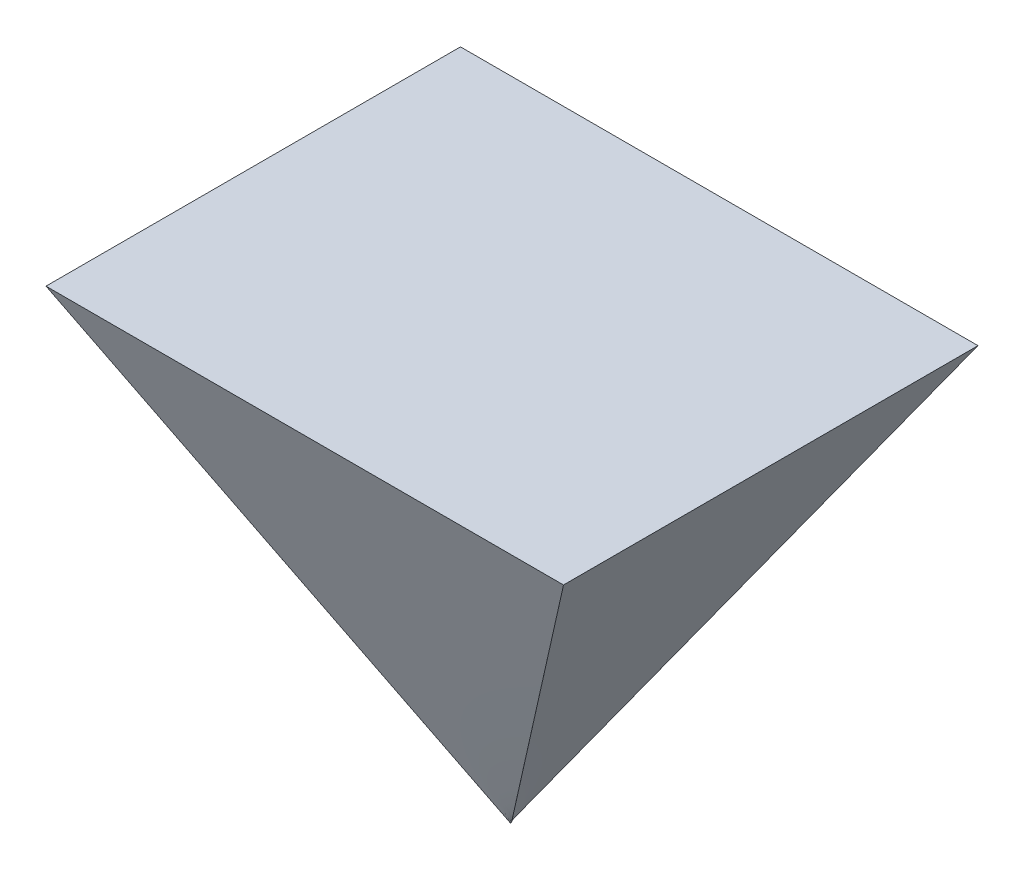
ISO-10303-21;
HEADER;
FILE_DESCRIPTION(('STEP AP214'),'2;1');
FILE_NAME('part.step','',(''),(''),'','','');
FILE_SCHEMA(('AUTOMOTIVE_DESIGN { 1 0 10303 214 1 1 1 1 }'));
ENDSEC;
DATA;
#1=APPLICATION_CONTEXT('core data for automotive mechanical design processes');
#2=APPLICATION_PROTOCOL_DEFINITION('international standard','automotive_design',2000,#1);
#3=PRODUCT_CONTEXT('',#1,'mechanical');
#4=PRODUCT('Part','Part','',(#3));
#5=PRODUCT_RELATED_PRODUCT_CATEGORY('part','',(#4));
#6=PRODUCT_DEFINITION_FORMATION('','',#4);
#7=PRODUCT_DEFINITION_CONTEXT('part definition',#1,'design');
#8=PRODUCT_DEFINITION('design','',#6,#7);
#9=PRODUCT_DEFINITION_SHAPE('','',#8);
#10=(LENGTH_UNIT() NAMED_UNIT(*) SI_UNIT(.MILLI.,.METRE.));
#11=(NAMED_UNIT(*) PLANE_ANGLE_UNIT() SI_UNIT($,.RADIAN.));
#12=(NAMED_UNIT(*) SI_UNIT($,.STERADIAN.) SOLID_ANGLE_UNIT());
#13=UNCERTAINTY_MEASURE_WITH_UNIT(LENGTH_MEASURE(1.E-05),#10,'distance_accuracy_value','');
#14=(GEOMETRIC_REPRESENTATION_CONTEXT(3) GLOBAL_UNCERTAINTY_ASSIGNED_CONTEXT((#13)) GLOBAL_UNIT_ASSIGNED_CONTEXT((#10,
#11,#12)) REPRESENTATION_CONTEXT('',''));
#15=CARTESIAN_POINT('',(0.,0.,0.));
#16=DIRECTION('',(0.,0.,1.));
#17=DIRECTION('',(1.,0.,0.));
#18=AXIS2_PLACEMENT_3D('',#15,#16,#17);
#19=CARTESIAN_POINT('',(2946.4,4978.4,-2354.58));
#20=DIRECTION('',(0.,1.,0.));
#21=DIRECTION('',(0.,0.,1.));
#22=AXIS2_PLACEMENT_3D('',#19,#20,#21);
#23=PLANE('',#22);
#24=DIRECTION('',(0.,0.,-1.));
#25=VECTOR('',#24,1.);
#26=CARTESIAN_POINT('',(2946.4,4978.4,2344.42));
#27=LINE('',#26,#25);
#28=CARTESIAN_POINT('',(2946.4,4978.4,2344.42));
#29=VERTEX_POINT('',#28);
#30=CARTESIAN_POINT('',(2946.4,4978.4,-2354.58));
#31=VERTEX_POINT('',#30);
#32=EDGE_CURVE('E134',#29,#31,#27,.T.);
#33=ORIENTED_EDGE('',*,*,#32,.T.);
#34=DIRECTION('',(-1.,0.,0.));
#35=VECTOR('',#34,1.);
#36=CARTESIAN_POINT('',(2946.4,4978.4,-2354.58));
#37=LINE('',#36,#35);
#38=CARTESIAN_POINT('',(-2921.,4978.4,-2354.58));
#39=VERTEX_POINT('',#38);
#40=EDGE_CURVE('E107',#31,#39,#37,.T.);
#41=ORIENTED_EDGE('',*,*,#40,.T.);
#42=DIRECTION('',(0.,0.,1.));
#43=VECTOR('',#42,1.);
#44=CARTESIAN_POINT('',(-2921.,4978.4,2344.42));
#45=LINE('',#44,#43);
#46=CARTESIAN_POINT('',(-2921.,4978.4,2344.42));
#47=VERTEX_POINT('',#46);
#48=EDGE_CURVE('E88',#39,#47,#45,.T.);
#49=ORIENTED_EDGE('',*,*,#48,.T.);
#50=DIRECTION('',(1.,0.,0.));
#51=VECTOR('',#50,1.);
#52=CARTESIAN_POINT('',(2946.4,4978.4,2344.42));
#53=LINE('',#52,#51);
#54=EDGE_CURVE('E79',#47,#29,#53,.T.);
#55=ORIENTED_EDGE('',*,*,#54,.T.);
#56=EDGE_LOOP('',(#33,#41,#49,#55));
#57=FACE_BOUND('',#56,.T.);
#58=ADVANCED_FACE('F40',(#57),#23,.T.);
#59=CARTESIAN_POINT('',(-6.477,0.,5.334));
#60=DIRECTION('',(0.,1.,0.));
#61=DIRECTION('',(0.,0.,1.));
#62=AXIS2_PLACEMENT_3D('',#59,#60,#61);
#63=PLANE('',#62);
#64=DIRECTION('',(0.,0.,1.));
#65=VECTOR('',#64,1.);
#66=CARTESIAN_POINT('',(-6.477,0.,-5.3086));
#67=LINE('',#66,#65);
#68=CARTESIAN_POINT('',(-6.477,0.,-5.3086));
#69=VERTEX_POINT('',#68);
#70=CARTESIAN_POINT('',(-6.477,0.,5.334));
#71=VERTEX_POINT('',#70);
#72=EDGE_CURVE('E197',#69,#71,#67,.T.);
#73=ORIENTED_EDGE('',*,*,#72,.F.);
#74=DIRECTION('',(-1.,0.,0.));
#75=VECTOR('',#74,1.);
#76=CARTESIAN_POINT('',(-6.477,0.,-5.3086));
#77=LINE('',#76,#75);
#78=CARTESIAN_POINT('',(6.477,0.,-5.3086));
#79=VERTEX_POINT('',#78);
#80=EDGE_CURVE('E12',#79,#69,#77,.T.);
#81=ORIENTED_EDGE('',*,*,#80,.F.);
#82=DIRECTION('',(0.,0.,-1.));
#83=VECTOR('',#82,1.);
#84=CARTESIAN_POINT('',(6.477,0.,-5.3086));
#85=LINE('',#84,#83);
#86=CARTESIAN_POINT('',(6.477,0.,5.334));
#87=VERTEX_POINT('',#86);
#88=EDGE_CURVE('E51',#87,#79,#85,.T.);
#89=ORIENTED_EDGE('',*,*,#88,.F.);
#90=DIRECTION('',(1.,0.,0.));
#91=VECTOR('',#90,1.);
#92=CARTESIAN_POINT('',(-6.477,0.,5.334));
#93=LINE('',#92,#91);
#94=EDGE_CURVE('E60',#71,#87,#93,.T.);
#95=ORIENTED_EDGE('',*,*,#94,.F.);
#96=EDGE_LOOP('',(#73,#81,#89,#95));
#97=FACE_BOUND('',#96,.T.);
#98=ADVANCED_FACE('F219',(#97),#63,.F.);
#99=CARTESIAN_POINT('',(6.477,0.,5.334));
#100=CARTESIAN_POINT('',(-2921.,4978.4,2344.42));
#101=CARTESIAN_POINT('',(6.477,0.,3.56023333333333));
#102=CARTESIAN_POINT('',(-1943.1,4978.4,2344.42));
#103=CARTESIAN_POINT('',(6.477,0.,1.78646666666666));
#104=CARTESIAN_POINT('',(-965.200000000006,4978.4,2344.42));
#105=CARTESIAN_POINT('',(6.477,0.,-1.76106666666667));
#106=CARTESIAN_POINT('',(990.599999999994,4978.4,2344.42));
#107=CARTESIAN_POINT('',(6.477,0.,-3.53483333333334));
#108=CARTESIAN_POINT('',(1968.5,4978.4,2344.42));
#109=CARTESIAN_POINT('',(6.477,0.,-5.3086));
#110=CARTESIAN_POINT('',(2946.4,4978.4,2344.42));
#111=B_SPLINE_SURFACE_WITH_KNOTS('',3,1,((#99,#100),(#101,#102),(#103,#104),(#105,#106),(#107,
#108),(#109,#110)),.UNSPECIFIED.,.F.,.F.,.F.,(4,2,4),(2,2),(0.,0.5,1.),(0.,1.),.UNSPECIFIED.);
#112=DIRECTION('',(0.471073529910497,0.797705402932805,0.376504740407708));
#113=VECTOR('',#112,1.);
#114=CARTESIAN_POINT('',(1476.4385,2489.2,1169.5557));
#115=LINE('',#114,#113);
#116=EDGE_CURVE('E94',#79,#29,#115,.T.);
#117=DIRECTION('',(0.469821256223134,-0.798967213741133,-0.37539229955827));
#118=VECTOR('',#117,1.);
#119=CARTESIAN_POINT('',(-1457.2615,2489.2,1174.877));
#120=LINE('',#119,#118);
#121=EDGE_CURVE('E85',#47,#87,#120,.T.);
#122=ORIENTED_EDGE('',*,*,#88,.T.);
#123=ORIENTED_EDGE('',*,*,#116,.T.);
#124=ORIENTED_EDGE('',*,*,#54,.F.);
#125=ORIENTED_EDGE('',*,*,#121,.T.);
#126=EDGE_LOOP('',(#122,#123,#124,#125));
#127=FACE_BOUND('',#126,.T.);
#128=ADVANCED_FACE('F99',(#127),#111,.T.);
#129=CARTESIAN_POINT('',(6.477,0.,-5.3086));
#130=CARTESIAN_POINT('',(2946.4,4978.4,2344.42));
#131=CARTESIAN_POINT('',(4.31800000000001,0.,-5.3086));
#132=CARTESIAN_POINT('',(2946.4,4978.4,1561.25333333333));
#133=CARTESIAN_POINT('',(2.15900000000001,0.,-5.3086));
#134=CARTESIAN_POINT('',(2946.4,4978.4,778.086666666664));
#135=CARTESIAN_POINT('',(-2.15899999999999,0.,-5.3086));
#136=CARTESIAN_POINT('',(2946.4,4978.4,-788.24666666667));
#137=CARTESIAN_POINT('',(-4.31799999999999,0.,-5.3086));
#138=CARTESIAN_POINT('',(2946.4,4978.4,-1571.41333333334));
#139=CARTESIAN_POINT('',(-6.477,0.,-5.3086));
#140=CARTESIAN_POINT('',(2946.4,4978.4,-2354.58));
#141=B_SPLINE_SURFACE_WITH_KNOTS('',3,1,((#129,#130),(#131,#132),(#133,#134),(#135,#136),(#137,
#138),(#139,#140)),.UNSPECIFIED.,.F.,.F.,.F.,(4,2,4),(2,2),(0.,0.5,1.),(0.,1.),.UNSPECIFIED.);
#142=DIRECTION('',(0.472699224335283,0.796946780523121,-0.376073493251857));
#143=VECTOR('',#142,1.);
#144=CARTESIAN_POINT('',(1469.9615,2489.2,-1179.9443));
#145=LINE('',#144,#143);
#146=EDGE_CURVE('E95',#69,#31,#145,.T.);
#147=ORIENTED_EDGE('',*,*,#80,.T.);
#148=ORIENTED_EDGE('',*,*,#146,.T.);
#149=ORIENTED_EDGE('',*,*,#32,.F.);
#150=ORIENTED_EDGE('',*,*,#116,.F.);
#151=EDGE_LOOP('',(#147,#148,#149,#150));
#152=FACE_BOUND('',#151,.T.);
#153=ADVANCED_FACE('F153',(#152),#141,.T.);
#154=CARTESIAN_POINT('',(-6.477,0.,5.334));
#155=CARTESIAN_POINT('',(-2921.,4978.4,-2354.58));
#156=CARTESIAN_POINT('',(-4.318,0.,5.334));
#157=CARTESIAN_POINT('',(-2921.,4978.4,-1571.41333333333));
#158=CARTESIAN_POINT('',(-2.159,0.,5.334));
#159=CARTESIAN_POINT('',(-2921.,4978.4,-788.246666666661));
#160=CARTESIAN_POINT('',(2.159,0.,5.334));
#161=CARTESIAN_POINT('',(-2921.,4978.4,778.086666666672));
#162=CARTESIAN_POINT('',(4.318,0.,5.334));
#163=CARTESIAN_POINT('',(-2921.,4978.4,1561.25333333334));
#164=CARTESIAN_POINT('',(6.477,0.,5.334));
#165=CARTESIAN_POINT('',(-2921.,4978.4,2344.42));
#166=B_SPLINE_SURFACE_WITH_KNOTS('',3,1,((#154,#155),(#156,#157),(#158,#159),(#160,#161),(#162,
#163),(#164,#165)),.UNSPECIFIED.,.F.,.F.,.F.,(4,2,4),(2,2),(0.,0.5,1.),(0.,1.),.UNSPECIFIED.);
#167=DIRECTION('',(-0.467608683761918,0.798738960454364,-0.378626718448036));
#168=VECTOR('',#167,1.);
#169=CARTESIAN_POINT('',(-1463.7385,2489.2,-1174.623));
#170=LINE('',#169,#168);
#171=EDGE_CURVE('E101',#71,#39,#170,.T.);
#172=ORIENTED_EDGE('',*,*,#94,.T.);
#173=ORIENTED_EDGE('',*,*,#121,.F.);
#174=ORIENTED_EDGE('',*,*,#48,.F.);
#175=ORIENTED_EDGE('',*,*,#171,.F.);
#176=EDGE_LOOP('',(#172,#173,#174,#175));
#177=FACE_BOUND('',#176,.T.);
#178=ADVANCED_FACE('F86',(#177),#166,.T.);
#179=CARTESIAN_POINT('',(-6.477,0.,-5.3086));
#180=CARTESIAN_POINT('',(2946.4,4978.4,-2354.58));
#181=CARTESIAN_POINT('',(-6.477,0.,-3.53483333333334));
#182=CARTESIAN_POINT('',(1968.49999999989,4978.4,-2354.58));
#183=CARTESIAN_POINT('',(-6.477,0.,-1.76106666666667));
#184=CARTESIAN_POINT('',(990.59999999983,4978.4,-2354.58));
#185=CARTESIAN_POINT('',(-6.477,0.,1.78646666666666));
#186=CARTESIAN_POINT('',(-965.20000000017,4978.4,-2354.58));
#187=CARTESIAN_POINT('',(-6.477,0.,3.56023333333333));
#188=CARTESIAN_POINT('',(-1943.10000000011,4978.4,-2354.58));
#189=CARTESIAN_POINT('',(-6.477,0.,5.334));
#190=CARTESIAN_POINT('',(-2921.,4978.4,-2354.58));
#191=B_SPLINE_SURFACE_WITH_KNOTS('',3,1,((#179,#180),(#181,#182),(#183,#184),(#185,#186),(#187,
#188),(#189,#190)),.UNSPECIFIED.,.F.,.F.,.F.,(4,2,4),(2,2),(0.,0.5,1.),(0.,1.),.UNSPECIFIED.);
#192=ORIENTED_EDGE('',*,*,#72,.T.);
#193=ORIENTED_EDGE('',*,*,#171,.T.);
#194=ORIENTED_EDGE('',*,*,#40,.F.);
#195=ORIENTED_EDGE('',*,*,#146,.F.);
#196=EDGE_LOOP('',(#192,#193,#194,#195));
#197=FACE_BOUND('',#196,.T.);
#198=ADVANCED_FACE('F209',(#197),#191,.T.);
#199=CLOSED_SHELL('',(#58,#98,#128,#153,#178,#198));
#200=MANIFOLD_SOLID_BREP('B2',#199);
#201=ADVANCED_BREP_SHAPE_REPRESENTATION('',(#18,#200),#14);
#202=SHAPE_DEFINITION_REPRESENTATION(#9,#201);
ENDSEC;
END-ISO-10303-21;
